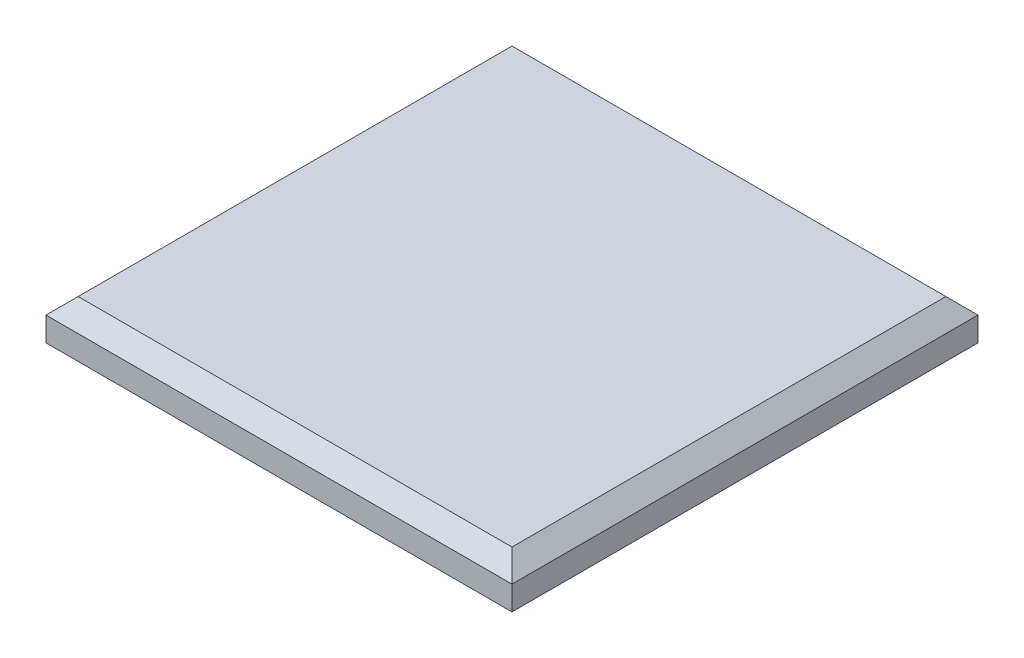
from build123d import *

# Parameters (mm, degrees)
SKETCH1_W           = 290
SKETCH1_H           = 290
BOSS_EXTRUDE1_DEPTH = 25
CHAMFER1_SIZE       = 10


with BuildPart() as part:
    # Sketch1 → Boss-Extrude1 (new body)
    with BuildSketch(Plane(origin=(0, 0, 0), x_dir=(1, 0, 0), z_dir=(0, 1, 0))):
        with Locations((0, 145)):
            Rectangle(SKETCH1_W, SKETCH1_H)
    extrude(amount=BOSS_EXTRUDE1_DEPTH)

    # Chamfer1
    chamfer1_edges = [part.edges().sort_by_distance(p)[0] for p in [
        (145, 25, -145),
        (0, 25, -290),
        (-145, 25, -145),
        (0, 25, 0),
    ]]
    chamfer(chamfer1_edges, length=CHAMFER1_SIZE)


solid = part.part
